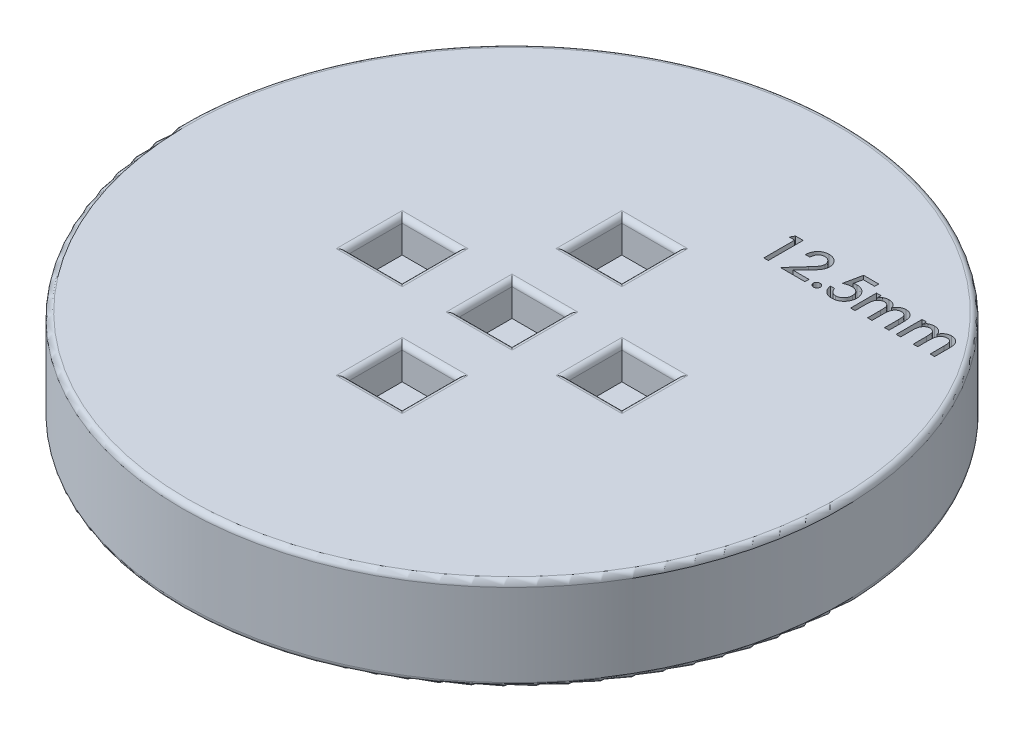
from build123d import *

# Parameters (mm, degrees)
SKETCH1_R           = 30
BOSS_EXTRUDE1_DEPTH = 8.5
SKETCH2_W           = 5
SKETCH2_H           = 5
CUT_EXTRUDE1_DEPTH  = 3
FILLET1_R           = 0.5
SKETCH4_W           = 5
SKETCH4_H           = 5
CUT_EXTRUDE2_DEPTH  = 3
FILLET2_R           = 0.5
FILLET3_R           = 0.5
CUT_EXTRUDE3_DEPTH  = 2


with BuildPart() as part:
    # Sketch1 → Boss-Extrude1 (new body)
    with BuildSketch(Plane(origin=(0, 0, 0), x_dir=(1, 0, 0), z_dir=(0, 1, 0))):
        with Locations(Location((0, 0, 0), (0, 0, 270))):
            Circle(SKETCH1_R)
    extrude(amount=BOSS_EXTRUDE1_DEPTH)

    # Sketch2 → Cut-Extrude1 (cut)
    with BuildSketch(Plane(origin=(0, 8.5, 0), x_dir=(1, 0, 0), z_dir=(0, 1, 0))):
        with Locations((0, -10)):
            Rectangle(SKETCH2_W, SKETCH2_H)
        with Locations((-10, 0)):
            Rectangle(SKETCH2_W, SKETCH2_H)
        Rectangle(SKETCH2_W, SKETCH2_H)
        with Locations((0, 10)):
            Rectangle(SKETCH2_W, SKETCH2_H)
        with Locations((10, 0)):
            Rectangle(SKETCH2_W, SKETCH2_H)
    extrude(amount=-CUT_EXTRUDE1_DEPTH, mode=Mode.SUBTRACT)

    # Fillet1
    fillet1_edges = [part.edges().sort_by_distance(p)[0] for p in [
        (2.5, 8.5, 0),
        (0, 8.5, 2.5),
        (-12.5, 8.5, 0),
        (-10, 8.5, 2.5),
        (-7.5, 8.5, 0),
        (-10, 8.5, -2.5),
    ]]
    fillet(fillet1_edges, radius=FILLET1_R)

    # Sketch4 → Cut-Extrude2 (cut)
    with BuildSketch(Plane(origin=(0, 0, 0), x_dir=(-1, 0, 0), z_dir=(0, -1, 0))):
        Rectangle(SKETCH4_W, SKETCH4_H)
        with Locations((0, -10)):
            Rectangle(SKETCH4_W, SKETCH4_H)
        with Locations((10, 0)):
            Rectangle(SKETCH4_W, SKETCH4_H)
        with Locations((-10, 0)):
            Rectangle(SKETCH4_W, SKETCH4_H)
        with Locations((0, 10)):
            Rectangle(SKETCH4_W, SKETCH4_H)
    extrude(amount=-CUT_EXTRUDE2_DEPTH, mode=Mode.SUBTRACT)

    # Fillet2
    fillet2_edges = [part.edges().sort_by_distance(p)[0] for p in [
        (-2.5, 0, 0),
        (0, 0, -2.5),
        (2.5, 0, 0),
        (0, 0, 2.5),
        (-2.5, 0, 10),
        (0, 0, 7.5),
        (2.5, 0, 10),
        (0, 0, 12.5),
        (-12.5, 0, 0),
        (-10, 0, -2.5),
        (-7.5, 0, 0),
        (-10, 0, 2.5),
        (7.5, 0, 0),
        (10, 0, -2.5),
        (12.5, 0, 0),
        (10, 0, 2.5),
        (2.5, 0, -10),
        (0, 0, -7.5),
        (-2.5, 0, -10),
        (0, 0, -12.5),
        (0, 0, -30),
    ]]
    fillet(fillet2_edges, radius=FILLET2_R)

    # Fillet3
    fillet3_edges = [part.edges().sort_by_distance(p)[0] for p in [
        (0, 8.5, -30),
        (0, 8.5, 7.5),
        (-2.5, 8.5, 10),
        (0, 8.5, 12.5),
        (2.5, 8.5, 10),
        (-2.5, 8.5, 0.25),
        (0.25, 8.5, -2.5),
        (0, 8.5, -12.5),
        (-2.5, 8.5, -10),
        (0, 8.5, -7.5),
        (2.5, 8.5, -10),
        (10, 8.5, 2.5),
        (12.5, 8.5, 0),
        (10, 8.5, -2.5),
        (7.5, 8.5, 0),
    ]]
    fillet(fillet3_edges, radius=FILLET3_R)

    # Sketch5 → Cut-Extrude3 (cut)
    with BuildSketch(Plane(origin=(0, 8.5, 0), x_dir=(1, 0, 0), z_dir=(0, 1, 0))):
        Polygon((6.909399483, 18.905280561), (7.600114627, 18.905280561), (7.600114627, 15.730280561), (7.193063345, 15.730280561), (7.193063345, 18.538934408), (6.704601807, 18.538934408), align=None)
        with BuildLine():
            Line((9.223867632, 17.887652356), (8.821268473, 17.887652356))
            add(Edge.make_bspline(
                [(8.821268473, 17.887652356), (8.823159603, 17.928618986), (8.826858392, 18.008744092), (8.843282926, 18.125495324), (8.869889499, 18.235504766), (8.903472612, 18.339705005), (8.948271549, 18.436793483), (8.99996056, 18.5284627), (9.062361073, 18.612791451), (9.132877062, 18.689913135), (9.209424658, 18.759981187), (9.291713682, 18.820399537), (9.378353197, 18.871884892), (9.469360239, 18.913897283), (9.564913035, 18.946426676), (9.664739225, 18.970097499), (9.769157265, 18.984334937), (9.840336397, 18.985898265), (9.876421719, 18.986690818)],
                knots=[0, 0, 0, 0, 1.154964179, 2.258951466, 3.315045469, 4.34063582, 5.337653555, 6.322213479, 7.300594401, 8.285733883, 9.262436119, 10.219305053, 11.156568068, 12.097250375, 13.037875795, 13.995471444, 14.983774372, 16, 16, 16, 16], degree=3))
            add(Edge.make_bspline(
                [(9.876421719, 18.986690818), (9.914203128, 18.985917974), (9.988340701, 18.98440144), (10.096302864, 18.970130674), (10.198479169, 18.947119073), (10.294899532, 18.915693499), (10.385388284, 18.873732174), (10.470123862, 18.823131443), (10.548291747, 18.762311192), (10.620459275, 18.694257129), (10.684201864, 18.619397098), (10.741774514, 18.542432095), (10.789363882, 18.46180118), (10.829231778, 18.378976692), (10.859910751, 18.293278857), (10.881576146, 18.205056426), (10.894562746, 18.114249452), (10.896335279, 18.052846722), (10.897230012, 18.021852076)],
                knots=[0, 0, 0, 0, 1.156722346, 2.269809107, 3.328396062, 4.361258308, 5.3694338, 6.377253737, 7.377324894, 8.397019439, 9.4098266, 10.385180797, 11.337325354, 12.27255833, 13.196816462, 14.119704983, 15.050871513, 16, 16, 16, 16], degree=3))
            add(Edge.make_bspline(
                [(10.897230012, 18.021852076), (10.895601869, 17.978495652), (10.892367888, 17.892376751), (10.86746523, 17.76496878), (10.825600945, 17.641664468), (10.777243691, 17.541262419), (10.728336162, 17.460106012), (10.683454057, 17.393118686), (10.630729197, 17.320685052), (10.569030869, 17.243289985), (10.500812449, 17.159162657), (10.423364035, 17.070473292), (10.339082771, 16.975426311), (10.278974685, 16.911426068), (10.247856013, 16.87829238)],
                knots=[0, 0, 0, 0, 1.155755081, 2.295677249, 3.447123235, 4.6205014, 5.259503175, 5.973005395, 6.77029923, 7.648035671, 8.612336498, 9.658570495, 10.787814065, 12, 12, 12, 12], degree=3))
            Line((10.247856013, 16.87829238), (9.466826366, 16.096626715))
            Line((9.466826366, 16.096626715), (10.93793514, 16.096626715))
            Line((10.93793514, 16.096626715), (10.93793514, 15.730280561))
            Line((10.93793514, 15.730280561), (8.699153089, 15.730280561))
            Line((8.699153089, 15.730280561), (9.913946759, 17.071641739))
            add(Edge.make_bspline(
                [(9.913946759, 17.071641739), (9.942881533, 17.102500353), (9.998407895, 17.161718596), (10.076664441, 17.248404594), (10.147269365, 17.328544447), (10.210599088, 17.402080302), (10.264995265, 17.470000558), (10.311921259, 17.53130599), (10.350845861, 17.586286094), (10.391269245, 17.651002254), (10.431324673, 17.728579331), (10.4653991, 17.823212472), (10.485845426, 17.919853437), (10.488733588, 17.984868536), (10.49017873, 18.017399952)],
                knots=[0, 0, 0, 0, 1.341560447, 2.574479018, 3.703506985, 4.728875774, 5.651874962, 6.462761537, 7.177175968, 7.787249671, 8.88179658, 9.938774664, 10.968630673, 12, 12, 12, 12], degree=3))
            add(Edge.make_bspline(
                [(10.49017873, 18.017399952), (10.489822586, 18.037581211), (10.489117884, 18.07751392), (10.479510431, 18.135990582), (10.465976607, 18.192709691), (10.445044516, 18.246759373), (10.419825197, 18.299202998), (10.388280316, 18.349362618), (10.350400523, 18.396772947), (10.308262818, 18.442500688), (10.261657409, 18.483787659), (10.21243096, 18.520816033), (10.159978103, 18.55088789), (10.105732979, 18.577186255), (10.048009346, 18.595830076), (9.98822612, 18.609711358), (9.925913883, 18.619327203), (9.883454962, 18.620000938), (9.861793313, 18.620344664)],
                knots=[0, 0, 0, 0, 0.999432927, 1.977580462, 2.931018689, 3.885672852, 4.844657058, 5.812871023, 6.815890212, 7.849665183, 8.891901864, 9.898878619, 10.897592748, 11.885014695, 12.882178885, 13.896915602, 14.927050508, 16, 16, 16, 16], degree=3))
            add(Edge.make_bspline(
                [(9.861793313, 18.620344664), (9.841199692, 18.619922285), (9.800686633, 18.619091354), (9.741021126, 18.610518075), (9.683749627, 18.596559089), (9.628678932, 18.577196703), (9.575410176, 18.553309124), (9.525245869, 18.522362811), (9.47736609, 18.486362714), (9.431137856, 18.445958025), (9.389064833, 18.39855528), (9.351433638, 18.344716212), (9.318203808, 18.284382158), (9.289800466, 18.217658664), (9.266261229, 18.144370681), (9.247378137, 18.064607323), (9.232779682, 17.978333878), (9.226893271, 17.918438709), (9.223867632, 17.887652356)],
                knots=[0, 0, 0, 0, 0.911540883, 1.79324023, 2.663162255, 3.518366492, 4.375475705, 5.243419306, 6.122264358, 7.02676621, 7.957780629, 8.921596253, 9.930241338, 11.002848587, 12.128200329, 13.335197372, 14.630280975, 16, 16, 16, 16], degree=3))
        make_face()
        with BuildLine():
            add(Edge.make_bspline(
                [(11.73168514, 16.300152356), (11.756398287, 16.299206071), (11.803988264, 16.297383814), (11.871563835, 16.279088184), (11.931745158, 16.248697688), (11.982183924, 16.206471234), (12.024475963, 16.158843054), (12.054505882, 16.106572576), (12.074840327, 16.051872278), (12.076730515, 16.013908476), (12.07767873, 15.994863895)],
                knots=[0, 0, 0, 0, 1.15701891, 2.228065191, 3.255424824, 4.294461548, 5.295444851, 6.226722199, 7.110433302, 8, 8, 8, 8], degree=3))
            add(Edge.make_bspline(
                [(12.07767873, 15.994863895), (12.076645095, 15.976057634), (12.074576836, 15.938427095), (12.055354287, 15.883637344), (12.02485926, 15.831485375), (11.983048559, 15.783316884), (11.932529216, 15.740884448), (11.871741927, 15.711474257), (11.804313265, 15.69216181), (11.75642015, 15.690456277), (11.73168514, 15.689575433)],
                knots=[0, 0, 0, 0, 0.879435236, 1.759712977, 2.690738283, 3.698978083, 4.737733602, 5.760330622, 6.843294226, 8, 8, 8, 8], degree=3))
            add(Edge.make_bspline(
                [(11.73168514, 15.689575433), (11.711223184, 15.690684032), (11.671084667, 15.692858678), (11.613262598, 15.709819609), (11.560804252, 15.73873013), (11.514068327, 15.777232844), (11.475331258, 15.82408312), (11.446946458, 15.87678539), (11.429565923, 15.934431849), (11.427470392, 15.974390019), (11.426396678, 15.994863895)],
                knots=[0, 0, 0, 0, 1.022542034, 2.005835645, 2.98339371, 4.000421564, 5.017449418, 6.004339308, 6.977457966, 8, 8, 8, 8], degree=3))
            add(Edge.make_bspline(
                [(11.426396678, 15.994863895), (11.427485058, 16.015542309), (11.429609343, 16.055902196), (11.44667253, 16.113896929), (11.475354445, 16.16633389), (11.514288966, 16.212496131), (11.560876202, 16.251240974), (11.613613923, 16.279596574), (11.671251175, 16.296984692), (11.711210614, 16.299079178), (11.73168514, 16.300152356)],
                knots=[0, 0, 0, 0, 1.03279153, 2.015790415, 2.993055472, 4.001620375, 5.018343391, 6.004937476, 6.977764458, 8, 8, 8, 8], degree=3))
        make_face()
        with BuildLine():
            Line((14.479281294, 18.905280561), (14.479281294, 18.538934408))
            Line((14.479281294, 18.538934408), (13.436212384, 18.538934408))
            Line((13.436212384, 18.538934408), (13.265759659, 17.786525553))
            add(Edge.make_bspline(
                [(13.265759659, 17.786525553), (13.285645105, 17.796108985), (13.326569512, 17.815831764), (13.394988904, 17.833016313), (13.469272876, 17.845107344), (13.521168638, 17.846317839), (13.548151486, 17.846947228)],
                knots=[0, 0, 0, 0, 0.906577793, 1.865744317, 2.890308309, 4, 4, 4, 4], degree=3))
            add(Edge.make_bspline(
                [(13.548151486, 17.846947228), (13.586367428, 17.846247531), (13.661398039, 17.844873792), (13.770749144, 17.829522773), (13.874950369, 17.806524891), (13.973144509, 17.772216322), (14.066452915, 17.729980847), (14.153863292, 17.677129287), (14.235284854, 17.614558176), (14.310608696, 17.543332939), (14.37925979, 17.465751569), (14.438221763, 17.381971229), (14.489331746, 17.294439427), (14.529844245, 17.201643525), (14.561853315, 17.104543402), (14.58461736, 17.002733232), (14.599089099, 16.896518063), (14.600620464, 16.824066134), (14.601396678, 16.78734186)],
                knots=[0, 0, 0, 0, 1.094894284, 2.149641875, 3.159658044, 4.149576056, 5.125966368, 6.091225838, 7.071072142, 8.064343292, 9.05924964, 10.03573454, 10.996966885, 11.96032995, 12.932910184, 13.923798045, 14.947619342, 16, 16, 16, 16], degree=3))
            add(Edge.make_bspline(
                [(14.601396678, 16.78734186), (14.600799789, 16.761679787), (14.599619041, 16.7109159), (14.593466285, 16.635433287), (14.581721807, 16.561578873), (14.566128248, 16.488782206), (14.544641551, 16.417667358), (14.520181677, 16.347288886), (14.49013077, 16.278768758), (14.455822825, 16.212135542), (14.417758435, 16.147876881), (14.375847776, 16.086772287), (14.329995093, 16.029310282), (14.280037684, 15.975971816), (14.227341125, 15.92538507), (14.170530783, 15.878870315), (14.109768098, 15.836232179), (14.045919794, 15.797004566), (13.979016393, 15.761565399), (13.908664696, 15.732222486), (13.836611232, 15.705561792), (13.761073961, 15.685599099), (13.683477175, 15.668801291), (13.602889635, 15.657653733), (13.519876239, 15.650385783), (13.46357705, 15.649381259), (13.434940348, 15.648870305)],
                knots=[0, 0, 0, 0, 1.012275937, 2.002451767, 2.98397589, 3.959820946, 4.936095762, 5.911940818, 6.896771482, 7.884012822, 8.866284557, 9.840372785, 10.804070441, 11.762530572, 12.720625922, 13.68308951, 14.655094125, 15.646011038, 16.637104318, 17.63729087, 18.650257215, 19.66446511, 20.715636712, 21.77986274, 22.870722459, 24, 24, 24, 24], degree=3))
            add(Edge.make_bspline(
                [(13.434940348, 15.648870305), (13.402686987, 15.649644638), (13.339057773, 15.651172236), (13.245605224, 15.662007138), (13.155952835, 15.68039076), (13.070480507, 15.706706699), (12.988552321, 15.739714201), (12.910866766, 15.78054639), (12.837121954, 15.828836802), (12.767222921, 15.883664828), (12.703472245, 15.946208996), (12.644708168, 16.013539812), (12.594640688, 16.088136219), (12.550596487, 16.16793963), (12.512752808, 16.253599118), (12.482646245, 16.345277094), (12.458572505, 16.442626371), (12.44895049, 16.509929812), (12.444024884, 16.544383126)],
                knots=[0, 0, 0, 0, 1.049569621, 2.070583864, 3.057046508, 4.023914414, 4.977170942, 5.927726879, 6.875021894, 7.842677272, 8.813672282, 9.777581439, 10.74592533, 11.731059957, 12.74126976, 13.788569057, 14.867946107, 16, 16, 16, 16], degree=3))
            Line((12.444024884, 16.544383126), (12.841535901, 16.544383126))
            add(Edge.make_bspline(
                [(12.841535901, 16.544383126), (12.849101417, 16.511109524), (12.863303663, 16.448647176), (12.893814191, 16.363537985), (12.926514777, 16.291151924), (12.966510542, 16.231952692), (13.012415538, 16.183359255), (13.063366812, 16.141178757), (13.119343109, 16.103341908), (13.180967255, 16.0719341), (13.245895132, 16.046488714), (13.31335739, 16.028729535), (13.381991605, 16.017562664), (13.42832672, 16.015998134), (13.451476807, 16.015216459)],
                knots=[0, 0, 0, 0, 1.385459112, 2.600831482, 3.66841355, 4.605180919, 5.48910649, 6.376050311, 7.288896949, 8.229144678, 9.181161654, 10.117453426, 11.059436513, 12, 12, 12, 12], degree=3))
            add(Edge.make_bspline(
                [(13.451476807, 16.015216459), (13.476519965, 16.016057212), (13.525962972, 16.017717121), (13.598800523, 16.027654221), (13.668460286, 16.046035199), (13.735948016, 16.069860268), (13.800084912, 16.102311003), (13.862445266, 16.140201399), (13.920755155, 16.186729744), (13.976644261, 16.238463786), (14.027833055, 16.295767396), (14.072405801, 16.357681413), (14.110428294, 16.422962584), (14.140728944, 16.492045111), (14.165320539, 16.564295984), (14.182223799, 16.640208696), (14.192769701, 16.719624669), (14.193813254, 16.773739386), (14.194345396, 16.801334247)],
                knots=[0, 0, 0, 0, 0.99750234, 1.969380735, 2.919490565, 3.862219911, 4.813679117, 5.776605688, 6.762898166, 7.778387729, 8.806918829, 9.816812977, 10.811632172, 11.809420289, 12.815921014, 13.846113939, 14.901663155, 16, 16, 16, 16], degree=3))
            add(Edge.make_bspline(
                [(14.194345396, 16.801334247), (14.193712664, 16.825955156), (14.192470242, 16.87430035), (14.183369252, 16.944958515), (14.168933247, 17.012357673), (14.147956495, 17.075864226), (14.120991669, 17.135829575), (14.08783328, 17.191870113), (14.048582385, 17.244297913), (14.004440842, 17.29328288), (13.954471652, 17.33705127), (13.900819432, 17.376223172), (13.841855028, 17.407904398), (13.779704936, 17.435015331), (13.71293156, 17.454829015), (13.642731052, 17.470794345), (13.567824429, 17.478464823), (13.516574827, 17.479876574), (13.490273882, 17.480601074)],
                knots=[0, 0, 0, 0, 1.071512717, 2.104004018, 3.095982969, 4.067795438, 5.009520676, 5.952827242, 6.895998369, 7.856350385, 8.817411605, 9.782937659, 10.74115891, 11.725120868, 12.729302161, 13.768330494, 14.854722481, 16, 16, 16, 16], degree=3))
            add(Edge.make_bspline(
                [(13.490273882, 17.480601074), (13.467782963, 17.480061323), (13.420565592, 17.47892817), (13.346678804, 17.47073464), (13.266275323, 17.457847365), (13.17948229, 17.440023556), (13.086216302, 17.41680274), (12.986364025, 17.388664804), (12.879814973, 17.355831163), (12.807119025, 17.330718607), (12.769665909, 17.317780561)],
                knots=[0, 0, 0, 0, 0.727614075, 1.527550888, 2.402655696, 3.361819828, 4.39328773, 5.511706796, 6.718025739, 8, 8, 8, 8], degree=3))
            Line((12.769665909, 17.317780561), (13.102939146, 18.905280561))
            Line((13.102939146, 18.905280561), (14.479281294, 18.905280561))
        make_face()
        with BuildLine():
            Line((15.089858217, 18.091177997), (15.496909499, 18.091177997))
            Line((15.496909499, 18.091177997), (15.496909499, 17.694939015))
            add(Edge.make_bspline(
                [(15.496909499, 17.694939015), (15.500818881, 17.711989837), (15.508446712, 17.745258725), (15.525243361, 17.792734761), (15.545763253, 17.836636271), (15.569117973, 17.878012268), (15.597497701, 17.915257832), (15.628541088, 17.950258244), (15.664481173, 17.980667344), (15.690519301, 17.998336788), (15.703615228, 18.00722367)],
                knots=[0, 0, 0, 0, 1.08898891, 2.124791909, 3.129224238, 4.105481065, 5.077441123, 6.040388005, 7.014409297, 8, 8, 8, 8], degree=3))
            add(Edge.make_bspline(
                [(15.703615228, 18.00722367), (15.743033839, 18.02653378), (15.820864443, 18.064660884), (15.943961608, 18.102534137), (16.068500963, 18.127767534), (16.152519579, 18.130509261), (16.194620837, 18.131883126)],
                knots=[0, 0, 0, 0, 1.028471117, 2.030678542, 3.013184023, 4, 4, 4, 4], degree=3))
            add(Edge.make_bspline(
                [(16.194620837, 18.131883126), (16.22562785, 18.131093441), (16.287117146, 18.129527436), (16.378163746, 18.11492734), (16.466589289, 18.091458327), (16.551559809, 18.059067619), (16.630828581, 18.019324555), (16.703202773, 17.974416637), (16.766909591, 17.923507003), (16.822768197, 17.867765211), (16.869182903, 17.805270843), (16.905783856, 17.73683911), (16.931749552, 17.661617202), (16.94058561, 17.608827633), (16.945121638, 17.581727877)],
                knots=[0, 0, 0, 0, 1.099015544, 2.179432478, 3.260947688, 4.338981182, 5.398181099, 6.40160478, 7.353922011, 8.284349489, 9.192639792, 10.104191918, 11.026778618, 12, 12, 12, 12], degree=3))
            add(Edge.make_bspline(
                [(16.945121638, 17.581727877), (16.952468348, 17.602611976), (16.966995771, 17.643908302), (16.993561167, 17.703402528), (17.025741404, 17.758933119), (17.062133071, 17.811242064), (17.102744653, 17.860651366), (17.149024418, 17.905441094), (17.198601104, 17.948110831), (17.2532725, 17.985514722), (17.310140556, 18.019826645), (17.368818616, 18.049739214), (17.428422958, 18.07537503), (17.489433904, 18.095519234), (17.551068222, 18.112473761), (17.614278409, 18.123877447), (17.678536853, 18.130086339), (17.721686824, 18.131283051), (17.743323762, 18.131883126)],
                knots=[0, 0, 0, 0, 1.024672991, 2.026193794, 3.01103273, 3.991165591, 4.973850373, 5.96628909, 6.969107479, 7.9982829, 9.028393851, 10.042340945, 11.044967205, 12.028827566, 13.014448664, 14.002022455, 14.998142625, 16, 16, 16, 16], degree=3))
            add(Edge.make_bspline(
                [(17.743323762, 18.131883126), (17.765390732, 18.131594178), (17.808772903, 18.131026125), (17.872691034, 18.124226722), (17.934600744, 18.114316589), (17.994407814, 18.099758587), (18.051895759, 18.080422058), (18.107340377, 18.057451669), (18.161015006, 18.030983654), (18.228121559, 17.98923346), (18.306349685, 17.930975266), (18.385724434, 17.846864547), (18.452249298, 17.753145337), (18.495472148, 17.665815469), (18.523010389, 17.589178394), (18.541513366, 17.524849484), (18.556383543, 17.453998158), (18.56925349, 17.37700783), (18.578480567, 17.293329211), (18.585310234, 17.203386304), (18.590020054, 17.106884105), (18.590335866, 17.040482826), (18.590499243, 17.006131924)],
                knots=[0, 0, 0, 0, 0.823429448, 1.618806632, 2.396867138, 3.162757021, 3.913573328, 4.658737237, 5.40200746, 6.144476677, 7.607081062, 9.028926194, 10.443018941, 11.88355177, 12.649646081, 13.481287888, 14.380074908, 15.350698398, 16.394246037, 17.521443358, 18.717785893, 20, 20, 20, 20], degree=3))
            Line((18.590499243, 17.006131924), (18.590499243, 15.730280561))
            Line((18.590499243, 15.730280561), (18.18344796, 15.730280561))
            Line((18.18344796, 15.730280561), (18.18344796, 17.004859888))
            add(Edge.make_bspline(
                [(18.18344796, 17.004859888), (18.183396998, 17.033271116), (18.183299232, 17.087774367), (18.180612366, 17.165807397), (18.176838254, 17.236633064), (18.172079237, 17.300317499), (18.165046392, 17.356953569), (18.156839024, 17.406610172), (18.147886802, 17.449332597), (18.132464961, 17.496036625), (18.108369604, 17.547087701), (18.070728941, 17.601611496), (18.02446303, 17.649605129), (17.970164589, 17.690840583), (17.909232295, 17.725051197), (17.841279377, 17.748124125), (17.768189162, 17.763568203), (17.717331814, 17.764868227), (17.691170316, 17.765536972)],
                knots=[0, 0, 0, 0, 1.305376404, 2.504195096, 3.587062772, 4.564309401, 5.437885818, 6.208191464, 6.877018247, 7.440755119, 8.464755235, 9.459136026, 10.471907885, 11.51427718, 12.582498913, 13.666986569, 14.799875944, 16, 16, 16, 16], degree=3))
            add(Edge.make_bspline(
                [(17.691170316, 17.765536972), (17.662020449, 17.764115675), (17.603651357, 17.761269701), (17.517447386, 17.740435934), (17.434690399, 17.704420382), (17.35525532, 17.656403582), (17.282329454, 17.595338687), (17.217735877, 17.522754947), (17.164443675, 17.437893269), (17.126809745, 17.359018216), (17.102514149, 17.286897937), (17.087173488, 17.222958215), (17.072861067, 17.150475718), (17.062828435, 17.068809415), (17.053421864, 16.978315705), (17.048486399, 16.878754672), (17.0442678, 16.770205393), (17.043897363, 16.694912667), (17.043704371, 16.65568621)],
                knots=[0, 0, 0, 0, 0.96585306, 1.934004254, 2.919496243, 3.947541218, 5.000269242, 6.060662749, 7.154254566, 8.311133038, 8.948925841, 9.673294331, 10.489200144, 11.396606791, 12.399336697, 13.504450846, 14.699853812, 16, 16, 16, 16], degree=3))
            Line((17.043704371, 16.65568621), (17.043704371, 15.730280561))
            Line((17.043704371, 15.730280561), (16.636653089, 15.730280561))
            Line((16.636653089, 15.730280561), (16.636653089, 16.927901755))
            add(Edge.make_bspline(
                [(16.636653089, 16.927901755), (16.636603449, 16.959916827), (16.636508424, 17.021202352), (16.633814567, 17.108985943), (16.630026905, 17.188712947), (16.625335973, 17.260237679), (16.618301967, 17.323448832), (16.61001952, 17.378386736), (16.601200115, 17.42535757), (16.585806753, 17.47597079), (16.562273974, 17.531436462), (16.524491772, 17.590204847), (16.477927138, 17.642034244), (16.422979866, 17.685754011), (16.361398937, 17.721560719), (16.29352973, 17.747190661), (16.220138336, 17.762846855), (16.169259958, 17.764623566), (16.143103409, 17.765536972)],
                knots=[0, 0, 0, 0, 1.376972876, 2.63589934, 3.777064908, 4.810071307, 5.718390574, 6.511518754, 7.200035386, 7.771255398, 8.78422519, 9.780850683, 10.762300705, 11.767731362, 12.789080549, 13.813681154, 14.876014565, 16, 16, 16, 16], degree=3))
            add(Edge.make_bspline(
                [(16.143103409, 17.765536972), (16.115226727, 17.764066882), (16.059216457, 17.761113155), (15.976129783, 17.740789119), (15.895103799, 17.706004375), (15.816293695, 17.659428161), (15.742330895, 17.600595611), (15.677316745, 17.528717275), (15.621945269, 17.445236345), (15.583657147, 17.366828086), (15.558483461, 17.296428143), (15.542402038, 17.23569108), (15.527479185, 17.168316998), (15.516492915, 17.093681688), (15.507607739, 17.012212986), (15.501418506, 16.92374003), (15.497571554, 16.828293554), (15.497135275, 16.762329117), (15.496909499, 16.72819222)],
                knots=[0, 0, 0, 0, 0.973948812, 1.956873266, 2.969584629, 4.045778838, 5.147278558, 6.259119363, 7.418022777, 8.637370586, 9.298195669, 10.027900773, 10.831491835, 11.708502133, 12.662464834, 13.694928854, 14.807115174, 16, 16, 16, 16], degree=3))
            Line((15.496909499, 16.72819222), (15.496909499, 15.730280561))
            Line((15.496909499, 15.730280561), (15.089858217, 15.730280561))
            Line((15.089858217, 15.730280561), (15.089858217, 18.091177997))
        make_face()
        with BuildLine():
            Line((19.241781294, 18.091177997), (19.648832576, 18.091177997))
            Line((19.648832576, 18.091177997), (19.648832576, 17.694939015))
            add(Edge.make_bspline(
                [(19.648832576, 17.694939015), (19.652741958, 17.711989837), (19.660369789, 17.745258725), (19.677166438, 17.792734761), (19.69768633, 17.836636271), (19.72104105, 17.878012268), (19.749420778, 17.915257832), (19.780464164, 17.950258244), (19.81640425, 17.980667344), (19.842442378, 17.998336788), (19.855538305, 18.00722367)],
                knots=[0, 0, 0, 0, 1.08898891, 2.124791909, 3.129224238, 4.105481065, 5.077441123, 6.040388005, 7.014409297, 8, 8, 8, 8], degree=3))
            add(Edge.make_bspline(
                [(19.855538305, 18.00722367), (19.894956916, 18.02653378), (19.97278752, 18.064660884), (20.095884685, 18.102534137), (20.22042404, 18.127767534), (20.304442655, 18.130509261), (20.346543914, 18.131883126)],
                knots=[0, 0, 0, 0, 1.028471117, 2.030678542, 3.013184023, 4, 4, 4, 4], degree=3))
            add(Edge.make_bspline(
                [(20.346543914, 18.131883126), (20.377550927, 18.131093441), (20.439040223, 18.129527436), (20.530086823, 18.11492734), (20.618512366, 18.091458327), (20.703482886, 18.059067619), (20.782751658, 18.019324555), (20.85512585, 17.974416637), (20.918832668, 17.923507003), (20.974691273, 17.867765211), (21.02110598, 17.805270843), (21.057706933, 17.73683911), (21.083672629, 17.661617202), (21.092508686, 17.608827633), (21.097044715, 17.581727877)],
                knots=[0, 0, 0, 0, 1.099015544, 2.179432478, 3.260947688, 4.338981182, 5.398181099, 6.40160478, 7.353922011, 8.284349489, 9.192639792, 10.104191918, 11.026778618, 12, 12, 12, 12], degree=3))
            add(Edge.make_bspline(
                [(21.097044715, 17.581727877), (21.104391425, 17.602611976), (21.118918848, 17.643908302), (21.145484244, 17.703402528), (21.177664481, 17.758933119), (21.214056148, 17.811242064), (21.25466773, 17.860651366), (21.300947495, 17.905441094), (21.35052418, 17.948110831), (21.405195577, 17.985514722), (21.462063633, 18.019826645), (21.520741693, 18.049739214), (21.580346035, 18.07537503), (21.641356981, 18.095519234), (21.702991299, 18.112473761), (21.766201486, 18.123877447), (21.83045993, 18.130086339), (21.873609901, 18.131283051), (21.895246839, 18.131883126)],
                knots=[0, 0, 0, 0, 1.024672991, 2.026193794, 3.01103273, 3.991165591, 4.973850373, 5.96628909, 6.969107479, 7.9982829, 9.028393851, 10.042340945, 11.044967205, 12.028827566, 13.014448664, 14.002022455, 14.998142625, 16, 16, 16, 16], degree=3))
            add(Edge.make_bspline(
                [(21.895246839, 18.131883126), (21.917313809, 18.131594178), (21.96069598, 18.131026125), (22.024614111, 18.124226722), (22.086523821, 18.114316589), (22.146330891, 18.099758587), (22.203818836, 18.080422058), (22.259263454, 18.057451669), (22.312938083, 18.030983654), (22.380044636, 17.98923346), (22.458272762, 17.930975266), (22.53764751, 17.846864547), (22.604172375, 17.753145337), (22.647395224, 17.665815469), (22.674933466, 17.589178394), (22.693436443, 17.524849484), (22.70830662, 17.453998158), (22.721176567, 17.37700783), (22.730403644, 17.293329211), (22.737233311, 17.203386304), (22.741943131, 17.106884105), (22.742258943, 17.040482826), (22.742422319, 17.006131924)],
                knots=[0, 0, 0, 0, 0.823429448, 1.618806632, 2.396867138, 3.162757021, 3.913573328, 4.658737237, 5.40200746, 6.144476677, 7.607081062, 9.028926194, 10.443018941, 11.88355177, 12.649646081, 13.481287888, 14.380074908, 15.350698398, 16.394246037, 17.521443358, 18.717785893, 20, 20, 20, 20], degree=3))
            Line((22.742422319, 17.006131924), (22.742422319, 15.730280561))
            Line((22.742422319, 15.730280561), (22.335371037, 15.730280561))
            Line((22.335371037, 15.730280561), (22.335371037, 17.004859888))
            add(Edge.make_bspline(
                [(22.335371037, 17.004859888), (22.335320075, 17.033271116), (22.335222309, 17.087774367), (22.332535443, 17.165807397), (22.328761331, 17.236633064), (22.324002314, 17.300317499), (22.316969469, 17.356953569), (22.308762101, 17.406610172), (22.299809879, 17.449332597), (22.284388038, 17.496036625), (22.260292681, 17.547087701), (22.222652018, 17.601611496), (22.176386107, 17.649605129), (22.122087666, 17.690840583), (22.061155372, 17.725051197), (21.993202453, 17.748124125), (21.920112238, 17.763568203), (21.869254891, 17.764868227), (21.843093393, 17.765536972)],
                knots=[0, 0, 0, 0, 1.305376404, 2.504195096, 3.587062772, 4.564309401, 5.437885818, 6.208191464, 6.877018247, 7.440755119, 8.464755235, 9.459136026, 10.471907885, 11.51427718, 12.582498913, 13.666986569, 14.799875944, 16, 16, 16, 16], degree=3))
            add(Edge.make_bspline(
                [(21.843093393, 17.765536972), (21.813943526, 17.764115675), (21.755574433, 17.761269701), (21.669370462, 17.740435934), (21.586613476, 17.704420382), (21.507178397, 17.656403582), (21.434252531, 17.595338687), (21.369658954, 17.522754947), (21.316366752, 17.437893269), (21.278732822, 17.359018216), (21.254437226, 17.286897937), (21.239096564, 17.222958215), (21.224784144, 17.150475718), (21.214751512, 17.068809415), (21.205344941, 16.978315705), (21.200409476, 16.878754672), (21.196190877, 16.770205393), (21.19582044, 16.694912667), (21.195627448, 16.65568621)],
                knots=[0, 0, 0, 0, 0.96585306, 1.934004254, 2.919496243, 3.947541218, 5.000269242, 6.060662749, 7.154254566, 8.311133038, 8.948925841, 9.673294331, 10.489200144, 11.396606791, 12.399336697, 13.504450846, 14.699853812, 16, 16, 16, 16], degree=3))
            Line((21.195627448, 16.65568621), (21.195627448, 15.730280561))
            Line((21.195627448, 15.730280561), (20.788576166, 15.730280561))
            Line((20.788576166, 15.730280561), (20.788576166, 16.927901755))
            add(Edge.make_bspline(
                [(20.788576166, 16.927901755), (20.788526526, 16.959916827), (20.788431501, 17.021202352), (20.785737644, 17.108985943), (20.781949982, 17.188712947), (20.77725905, 17.260237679), (20.770225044, 17.323448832), (20.761942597, 17.378386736), (20.753123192, 17.42535757), (20.73772983, 17.47597079), (20.714197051, 17.531436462), (20.676414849, 17.590204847), (20.629850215, 17.642034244), (20.574902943, 17.685754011), (20.513322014, 17.721560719), (20.445452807, 17.747190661), (20.372061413, 17.762846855), (20.321183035, 17.764623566), (20.295026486, 17.765536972)],
                knots=[0, 0, 0, 0, 1.376972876, 2.63589934, 3.777064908, 4.810071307, 5.718390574, 6.511518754, 7.200035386, 7.771255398, 8.78422519, 9.780850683, 10.762300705, 11.767731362, 12.789080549, 13.813681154, 14.876014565, 16, 16, 16, 16], degree=3))
            add(Edge.make_bspline(
                [(20.295026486, 17.765536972), (20.267149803, 17.764066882), (20.211139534, 17.761113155), (20.12805286, 17.740789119), (20.047026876, 17.706004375), (19.968216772, 17.659428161), (19.894253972, 17.600595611), (19.829239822, 17.528717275), (19.773868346, 17.445236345), (19.735580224, 17.366828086), (19.710406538, 17.296428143), (19.694325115, 17.23569108), (19.679402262, 17.168316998), (19.668415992, 17.093681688), (19.659530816, 17.012212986), (19.653341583, 16.92374003), (19.649494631, 16.828293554), (19.649058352, 16.762329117), (19.648832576, 16.72819222)],
                knots=[0, 0, 0, 0, 0.973948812, 1.956873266, 2.969584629, 4.045778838, 5.147278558, 6.259119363, 7.418022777, 8.637370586, 9.298195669, 10.027900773, 10.831491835, 11.708502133, 12.662464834, 13.694928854, 14.807115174, 16, 16, 16, 16], degree=3))
            Line((19.648832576, 16.72819222), (19.648832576, 15.730280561))
            Line((19.648832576, 15.730280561), (19.241781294, 15.730280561))
            Line((19.241781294, 15.730280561), (19.241781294, 18.091177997))
        make_face()
    extrude(amount=-CUT_EXTRUDE3_DEPTH, mode=Mode.SUBTRACT)


solid = part.part
